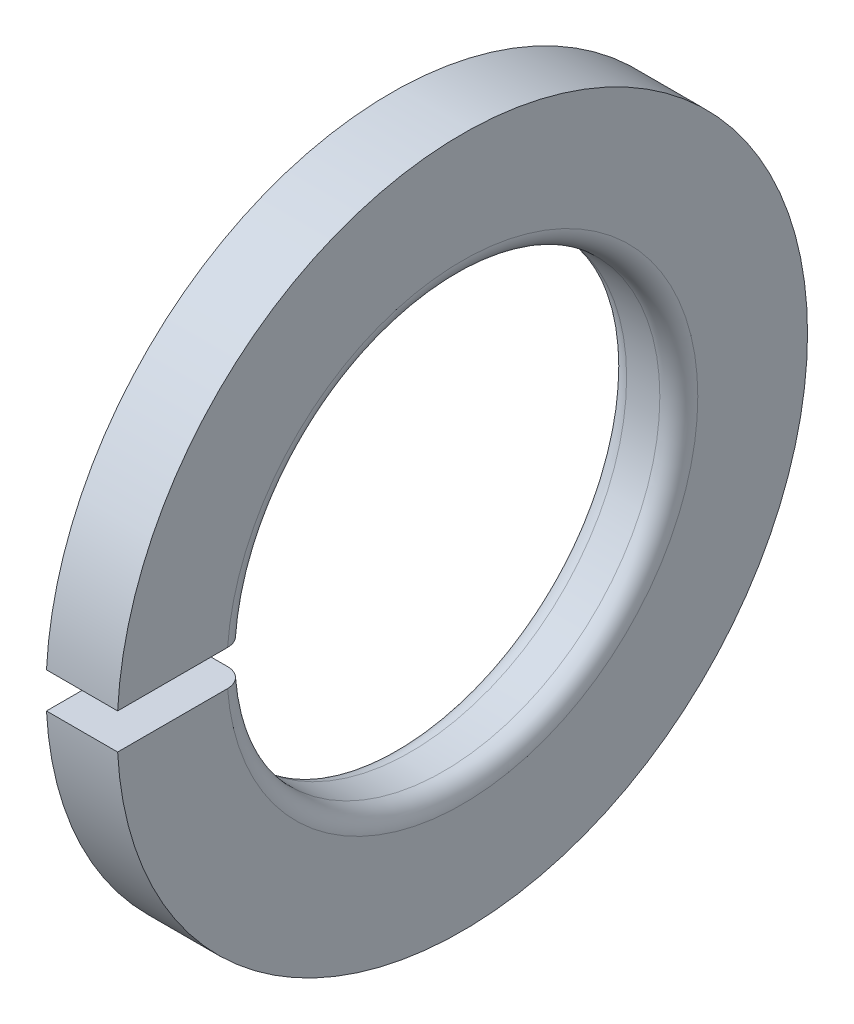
from build123d import *

# Parameters (mm, degrees)
SKETCH2_W = 3
SKETCH2_H = 29.682
GAP_DEPTH = 42.588700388


with BuildPart() as part:
    # Sketch1 → Base-Revolve (revolve)
    with BuildSketch(Plane.XY, mode=Mode.PRIVATE) as base_revolve_sk:
        with BuildLine():
            Line((0, 19.85), (0, 29.1))
            Line((0, 29.1), (-6, 29.1))
            Line((-6, 29.1), (-6, 19.85))
            ThreePointArc((-6, 19.85), (-5.53137085, 18.71862915), (-4.4, 18.25))
            Line((-4.4, 18.25), (-1.6, 18.25))
            ThreePointArc((-1.6, 18.25), (-0.46862915, 18.71862915), (0, 19.85))
        make_face()
    revolve(base_revolve_sk.sketch.rotate(Axis((-34.925, 0, 0), (1, 0, 0)), 90), axis=Axis((-34.925, 0, 0), (1, 0, 0)))

    # Sketch2 → Gap (cut, through all)
    with BuildSketch(Plane(origin=(0, 0, 0), x_dir=(0, -1, 0), z_dir=(-1, 0, 0))):
        with Locations((0, 14.841)):
            Rectangle(SKETCH2_W, SKETCH2_H)
    extrude(amount=GAP_DEPTH, mode=Mode.SUBTRACT)


solid = part.part
